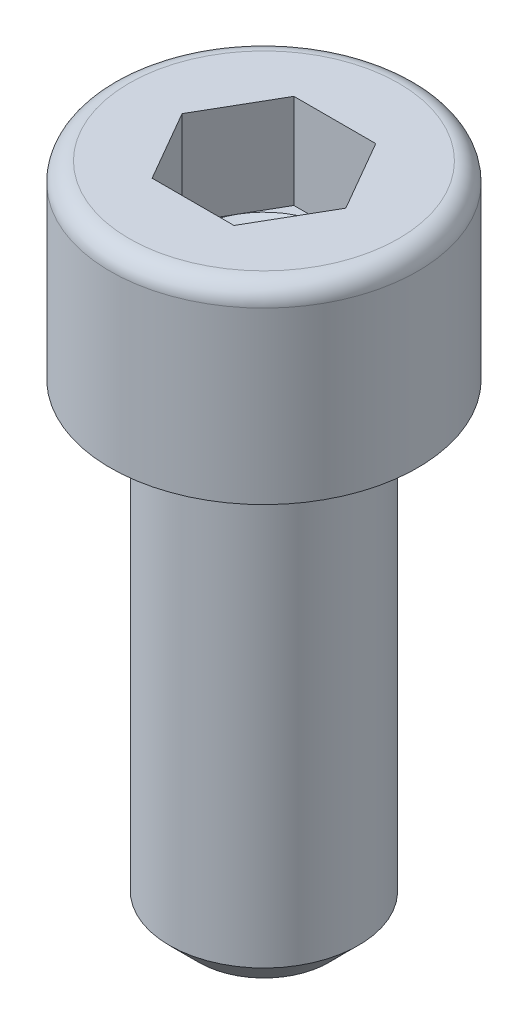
ISO-10303-21;
HEADER;
FILE_DESCRIPTION(('STEP AP214'),'2;1');
FILE_NAME('part.step','',(''),(''),'','','');
FILE_SCHEMA(('AUTOMOTIVE_DESIGN { 1 0 10303 214 1 1 1 1 }'));
ENDSEC;
DATA;
#1=APPLICATION_CONTEXT('core data for automotive mechanical design processes');
#2=APPLICATION_PROTOCOL_DEFINITION('international standard','automotive_design',2000,#1);
#3=PRODUCT_CONTEXT('',#1,'mechanical');
#4=PRODUCT('Part','Part','',(#3));
#5=PRODUCT_RELATED_PRODUCT_CATEGORY('part','',(#4));
#6=PRODUCT_DEFINITION_FORMATION('','',#4);
#7=PRODUCT_DEFINITION_CONTEXT('part definition',#1,'design');
#8=PRODUCT_DEFINITION('design','',#6,#7);
#9=PRODUCT_DEFINITION_SHAPE('','',#8);
#10=(LENGTH_UNIT() NAMED_UNIT(*) SI_UNIT(.MILLI.,.METRE.));
#11=(NAMED_UNIT(*) PLANE_ANGLE_UNIT() SI_UNIT($,.RADIAN.));
#12=(NAMED_UNIT(*) SI_UNIT($,.STERADIAN.) SOLID_ANGLE_UNIT());
#13=UNCERTAINTY_MEASURE_WITH_UNIT(LENGTH_MEASURE(1.E-05),#10,'distance_accuracy_value','');
#14=(GEOMETRIC_REPRESENTATION_CONTEXT(3) GLOBAL_UNCERTAINTY_ASSIGNED_CONTEXT((#13)) GLOBAL_UNIT_ASSIGNED_CONTEXT((#10,
#11,#12)) REPRESENTATION_CONTEXT('',''));
#15=CARTESIAN_POINT('',(0.,0.,0.));
#16=DIRECTION('',(0.,0.,1.));
#17=DIRECTION('',(1.,0.,0.));
#18=AXIS2_PLACEMENT_3D('',#15,#16,#17);
#19=CARTESIAN_POINT('',(2.99999999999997,8.00000000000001,0.));
#20=DIRECTION('',(0.,-1.,0.));
#21=DIRECTION('',(1.,0.,0.));
#22=AXIS2_PLACEMENT_3D('',#19,#20,#21);
#23=PLANE('',#22);
#24=CARTESIAN_POINT('',(0.,8.00000000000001,0.));
#25=DIRECTION('',(0.,1.,0.));
#26=DIRECTION('',(-1.,0.,0.));
#27=AXIS2_PLACEMENT_3D('',#24,#25,#26);
#28=CIRCLE('',#27,5.7);
#29=CARTESIAN_POINT('',(-5.70000000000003,8.00000000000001,0.));
#30=VERTEX_POINT('',#29);
#31=EDGE_CURVE('E173',#30,#30,#28,.T.);
#32=ORIENTED_EDGE('',*,*,#31,.T.);
#33=EDGE_LOOP('',(#32));
#34=FACE_BOUND('',#33,.T.);
#35=DIRECTION('',(0.5,0.,0.866025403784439));
#36=VECTOR('',#35,1.);
#37=CARTESIAN_POINT('',(1.73205080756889,8.00000000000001,-3.00000000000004));
#38=LINE('',#37,#36);
#39=CARTESIAN_POINT('',(1.73205080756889,8.00000000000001,-3.00000000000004));
#40=VERTEX_POINT('',#39);
#41=CARTESIAN_POINT('',(3.46410161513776,8.00000000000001,0.));
#42=VERTEX_POINT('',#41);
#43=EDGE_CURVE('E114',#40,#42,#38,.T.);
#44=ORIENTED_EDGE('',*,*,#43,.T.);
#45=DIRECTION('',(-0.499999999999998,0.,0.866025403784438));
#46=VECTOR('',#45,1.);
#47=CARTESIAN_POINT('',(1.7320508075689,8.00000000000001,2.99999999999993));
#48=LINE('',#47,#46);
#49=CARTESIAN_POINT('',(1.7320508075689,8.00000000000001,2.99999999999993));
#50=VERTEX_POINT('',#49);
#51=EDGE_CURVE('E132',#42,#50,#48,.T.);
#52=ORIENTED_EDGE('',*,*,#51,.T.);
#53=DIRECTION('',(-1.,0.,0.));
#54=VECTOR('',#53,1.);
#55=CARTESIAN_POINT('',(1.7320508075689,8.00000000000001,2.99999999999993));
#56=LINE('',#55,#54);
#57=CARTESIAN_POINT('',(-1.73205080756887,8.00000000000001,2.99999999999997));
#58=VERTEX_POINT('',#57);
#59=EDGE_CURVE('E135',#50,#58,#56,.T.);
#60=ORIENTED_EDGE('',*,*,#59,.T.);
#61=DIRECTION('',(-0.499999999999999,0.,-0.866025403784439));
#62=VECTOR('',#61,1.);
#63=CARTESIAN_POINT('',(-1.73205080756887,8.00000000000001,2.99999999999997));
#64=LINE('',#63,#62);
#65=CARTESIAN_POINT('',(-3.46410161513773,8.00000000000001,0.));
#66=VERTEX_POINT('',#65);
#67=EDGE_CURVE('E128',#58,#66,#64,.T.);
#68=ORIENTED_EDGE('',*,*,#67,.T.);
#69=DIRECTION('',(0.499999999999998,0.,-0.866025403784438));
#70=VECTOR('',#69,1.);
#71=CARTESIAN_POINT('',(-1.73205080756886,8.00000000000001,-3.00000000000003));
#72=LINE('',#71,#70);
#73=CARTESIAN_POINT('',(-1.73205080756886,8.00000000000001,-3.00000000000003));
#74=VERTEX_POINT('',#73);
#75=EDGE_CURVE('E115',#66,#74,#72,.T.);
#76=ORIENTED_EDGE('',*,*,#75,.T.);
#77=DIRECTION('',(1.,0.,0.));
#78=VECTOR('',#77,1.);
#79=CARTESIAN_POINT('',(1.73205080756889,8.00000000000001,-3.00000000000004));
#80=LINE('',#79,#78);
#81=EDGE_CURVE('E105',#74,#40,#80,.T.);
#82=ORIENTED_EDGE('',*,*,#81,.T.);
#83=EDGE_LOOP('',(#44,#52,#60,#68,#76,#82));
#84=FACE_BOUND('',#83,.T.);
#85=ADVANCED_FACE('F34',(#34,#84),#23,.F.);
#86=CARTESIAN_POINT('',(0.,-20.,0.));
#87=DIRECTION('',(0.,1.,0.));
#88=DIRECTION('',(0.,0.,0.999999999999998));
#89=AXIS2_PLACEMENT_3D('',#86,#87,#88);
#90=CYLINDRICAL_SURFACE('',#89,4.);
#91=CARTESIAN_POINT('',(0.,-18.75,0.));
#92=DIRECTION('',(0.,1.,0.));
#93=DIRECTION('',(0.,0.,0.999999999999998));
#94=AXIS2_PLACEMENT_3D('',#91,#92,#93);
#95=CIRCLE('',#94,4.);
#96=CARTESIAN_POINT('',(0.,-18.75,3.99999999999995));
#97=VERTEX_POINT('',#96);
#98=EDGE_CURVE('E42',#97,#97,#95,.T.);
#99=ORIENTED_EDGE('',*,*,#98,.T.);
#100=EDGE_LOOP('',(#99));
#101=FACE_BOUND('',#100,.T.);
#102=CARTESIAN_POINT('',(0.,0.,0.));
#103=DIRECTION('',(0.,1.,0.));
#104=DIRECTION('',(0.,0.,0.999999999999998));
#105=AXIS2_PLACEMENT_3D('',#102,#103,#104);
#106=CIRCLE('',#105,4.);
#107=CARTESIAN_POINT('',(0.,0.,3.99999999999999));
#108=VERTEX_POINT('',#107);
#109=EDGE_CURVE('E183',#108,#108,#106,.T.);
#110=ORIENTED_EDGE('',*,*,#109,.F.);
#111=EDGE_LOOP('',(#110));
#112=FACE_BOUND('',#111,.T.);
#113=ADVANCED_FACE('F36',(#101,#112),#90,.T.);
#114=CARTESIAN_POINT('',(0.,-20.,0.));
#115=DIRECTION('',(0.,1.,0.));
#116=DIRECTION('',(0.,0.,0.999999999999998));
#117=AXIS2_PLACEMENT_3D('',#114,#115,#116);
#118=PLANE('',#117);
#119=CARTESIAN_POINT('',(0.,-20.,0.));
#120=DIRECTION('',(0.,1.,0.));
#121=DIRECTION('',(0.,0.,0.999999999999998));
#122=AXIS2_PLACEMENT_3D('',#119,#120,#121);
#123=CIRCLE('',#122,2.75);
#124=CARTESIAN_POINT('',(0.,-20.,2.74999999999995));
#125=VERTEX_POINT('',#124);
#126=EDGE_CURVE('E11',#125,#125,#123,.F.);
#127=ORIENTED_EDGE('',*,*,#126,.T.);
#128=EDGE_LOOP('',(#127));
#129=FACE_BOUND('',#128,.T.);
#130=ADVANCED_FACE('F193',(#129),#118,.F.);
#131=CARTESIAN_POINT('',(0.,-18.75,0.));
#132=DIRECTION('',(0.,1.,0.));
#133=DIRECTION('',(0.,0.,0.999999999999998));
#134=AXIS2_PLACEMENT_3D('',#131,#132,#133);
#135=CONICAL_SURFACE('',#134,4.,0.785398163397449);
#136=ORIENTED_EDGE('',*,*,#126,.F.);
#137=EDGE_LOOP('',(#136));
#138=FACE_BOUND('',#137,.T.);
#139=ORIENTED_EDGE('',*,*,#98,.F.);
#140=EDGE_LOOP('',(#139));
#141=FACE_BOUND('',#140,.T.);
#142=ADVANCED_FACE('F190',(#138,#141),#135,.T.);
#143=CARTESIAN_POINT('',(0.,0.,0.));
#144=DIRECTION('',(0.,1.,0.));
#145=DIRECTION('',(-1.,0.,0.));
#146=AXIS2_PLACEMENT_3D('',#143,#144,#145);
#147=PLANE('',#146);
#148=ORIENTED_EDGE('',*,*,#109,.T.);
#149=EDGE_LOOP('',(#148));
#150=FACE_BOUND('',#149,.T.);
#151=CARTESIAN_POINT('',(0.,0.,0.));
#152=DIRECTION('',(0.,1.,0.));
#153=DIRECTION('',(-1.,0.,0.));
#154=AXIS2_PLACEMENT_3D('',#151,#152,#153);
#155=CIRCLE('',#154,6.5);
#156=CARTESIAN_POINT('',(-6.50000000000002,0.,0.));
#157=VERTEX_POINT('',#156);
#158=EDGE_CURVE('E180',#157,#157,#155,.T.);
#159=ORIENTED_EDGE('',*,*,#158,.F.);
#160=EDGE_LOOP('',(#159));
#161=FACE_BOUND('',#160,.T.);
#162=ADVANCED_FACE('F192',(#150,#161),#147,.F.);
#163=CARTESIAN_POINT('',(0.,8.00000000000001,0.));
#164=DIRECTION('',(0.,1.,0.));
#165=DIRECTION('',(-1.,0.,0.));
#166=AXIS2_PLACEMENT_3D('',#163,#164,#165);
#167=CYLINDRICAL_SURFACE('',#166,6.5);
#168=CARTESIAN_POINT('',(0.,7.19999999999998,0.));
#169=DIRECTION('',(0.,1.,0.));
#170=DIRECTION('',(-1.,0.,0.));
#171=AXIS2_PLACEMENT_3D('',#168,#169,#170);
#172=CIRCLE('',#171,6.5);
#173=CARTESIAN_POINT('',(-6.50000000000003,7.19999999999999,0.));
#174=VERTEX_POINT('',#173);
#175=EDGE_CURVE('E177',#174,#174,#172,.T.);
#176=ORIENTED_EDGE('',*,*,#175,.F.);
#177=EDGE_LOOP('',(#176));
#178=FACE_BOUND('',#177,.T.);
#179=ORIENTED_EDGE('',*,*,#158,.T.);
#180=EDGE_LOOP('',(#179));
#181=FACE_BOUND('',#180,.T.);
#182=ADVANCED_FACE('F200',(#178,#181),#167,.T.);
#183=CARTESIAN_POINT('',(0.,7.19999999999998,0.));
#184=DIRECTION('',(0.,1.,0.));
#185=DIRECTION('',(-1.,0.,0.));
#186=AXIS2_PLACEMENT_3D('',#183,#184,#185);
#187=TOROIDAL_SURFACE('',#186,5.7,0.8);
#188=ORIENTED_EDGE('',*,*,#31,.F.);
#189=EDGE_LOOP('',(#188));
#190=FACE_BOUND('',#189,.T.);
#191=ORIENTED_EDGE('',*,*,#175,.T.);
#192=EDGE_LOOP('',(#191));
#193=FACE_BOUND('',#192,.T.);
#194=ADVANCED_FACE('F215',(#190,#193),#187,.T.);
#195=CARTESIAN_POINT('',(-1.73205080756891,4.,-3.00000000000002));
#196=DIRECTION('',(0.866025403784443,0.,0.499999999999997));
#197=DIRECTION('',(0.499999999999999,0.,-0.866025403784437));
#198=AXIS2_PLACEMENT_3D('',#195,#196,#197);
#199=PLANE('',#198);
#200=ORIENTED_EDGE('',*,*,#75,.F.);
#201=DIRECTION('',(0.,1.,0.));
#202=VECTOR('',#201,1.);
#203=CARTESIAN_POINT('',(-3.4641016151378,4.,0.));
#204=LINE('',#203,#202);
#205=CARTESIAN_POINT('',(-3.4641016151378,4.,0.));
#206=VERTEX_POINT('',#205);
#207=EDGE_CURVE('E158',#206,#66,#204,.T.);
#208=ORIENTED_EDGE('',*,*,#207,.F.);
#209=DIRECTION('',(0.499999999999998,0.,-0.866025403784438));
#210=VECTOR('',#209,1.);
#211=CARTESIAN_POINT('',(-1.73205080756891,4.,-3.00000000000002));
#212=LINE('',#211,#210);
#213=CARTESIAN_POINT('',(-2.59807621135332,4.,-1.50000000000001));
#214=VERTEX_POINT('',#213);
#215=EDGE_CURVE('E138',#206,#214,#212,.T.);
#216=ORIENTED_EDGE('',*,*,#215,.T.);
#217=CARTESIAN_POINT('',(-1.73205080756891,4.,-3.00000000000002));
#218=VERTEX_POINT('',#217);
#219=EDGE_CURVE('E123',#214,#218,#212,.T.);
#220=ORIENTED_EDGE('',*,*,#219,.T.);
#221=DIRECTION('',(0.,1.,0.));
#222=VECTOR('',#221,1.);
#223=CARTESIAN_POINT('',(-1.73205080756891,4.,-3.00000000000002));
#224=LINE('',#223,#222);
#225=EDGE_CURVE('E108',#218,#74,#224,.T.);
#226=ORIENTED_EDGE('',*,*,#225,.T.);
#227=EDGE_LOOP('',(#200,#208,#216,#220,#226));
#228=FACE_BOUND('',#227,.T.);
#229=ADVANCED_FACE('F118',(#228),#199,.T.);
#230=CARTESIAN_POINT('',(1.73205080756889,4.,-3.));
#231=DIRECTION('',(0.,0.,0.999999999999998));
#232=DIRECTION('',(1.,0.,0.));
#233=AXIS2_PLACEMENT_3D('',#230,#231,#232);
#234=PLANE('',#233);
#235=ORIENTED_EDGE('',*,*,#81,.F.);
#236=ORIENTED_EDGE('',*,*,#225,.F.);
#237=DIRECTION('',(1.,0.,0.));
#238=VECTOR('',#237,1.);
#239=CARTESIAN_POINT('',(1.73205080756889,4.,-3.));
#240=LINE('',#239,#238);
#241=CARTESIAN_POINT('',(0.,4.,-3.));
#242=VERTEX_POINT('',#241);
#243=EDGE_CURVE('E49',#218,#242,#240,.T.);
#244=ORIENTED_EDGE('',*,*,#243,.T.);
#245=CARTESIAN_POINT('',(1.73205080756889,4.,-3.));
#246=VERTEX_POINT('',#245);
#247=EDGE_CURVE('E140',#242,#246,#240,.T.);
#248=ORIENTED_EDGE('',*,*,#247,.T.);
#249=DIRECTION('',(0.,1.,0.));
#250=VECTOR('',#249,1.);
#251=CARTESIAN_POINT('',(1.73205080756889,4.,-3.));
#252=LINE('',#251,#250);
#253=EDGE_CURVE('E110',#246,#40,#252,.T.);
#254=ORIENTED_EDGE('',*,*,#253,.T.);
#255=EDGE_LOOP('',(#235,#236,#244,#248,#254));
#256=FACE_BOUND('',#255,.T.);
#257=ADVANCED_FACE('F107',(#256),#234,.T.);
#258=CARTESIAN_POINT('',(1.73205080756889,4.,-3.));
#259=DIRECTION('',(-0.866025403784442,0.,0.499999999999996));
#260=DIRECTION('',(0.5,0.,0.866025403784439));
#261=AXIS2_PLACEMENT_3D('',#258,#259,#260);
#262=PLANE('',#261);
#263=ORIENTED_EDGE('',*,*,#43,.F.);
#264=ORIENTED_EDGE('',*,*,#253,.F.);
#265=DIRECTION('',(0.5,0.,0.866025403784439));
#266=VECTOR('',#265,1.);
#267=CARTESIAN_POINT('',(1.73205080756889,4.,-3.));
#268=LINE('',#267,#266);
#269=CARTESIAN_POINT('',(2.59807621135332,4.,-1.49999999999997));
#270=VERTEX_POINT('',#269);
#271=EDGE_CURVE('E143',#246,#270,#268,.T.);
#272=ORIENTED_EDGE('',*,*,#271,.T.);
#273=CARTESIAN_POINT('',(3.46410161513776,4.,0.));
#274=VERTEX_POINT('',#273);
#275=EDGE_CURVE('E142',#270,#274,#268,.T.);
#276=ORIENTED_EDGE('',*,*,#275,.T.);
#277=DIRECTION('',(0.,1.,0.));
#278=VECTOR('',#277,1.);
#279=CARTESIAN_POINT('',(3.46410161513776,4.,0.));
#280=LINE('',#279,#278);
#281=EDGE_CURVE('E166',#274,#42,#280,.T.);
#282=ORIENTED_EDGE('',*,*,#281,.T.);
#283=EDGE_LOOP('',(#263,#264,#272,#276,#282));
#284=FACE_BOUND('',#283,.T.);
#285=ADVANCED_FACE('F246',(#284),#262,.T.);
#286=CARTESIAN_POINT('',(1.73205080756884,4.,2.99999999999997));
#287=DIRECTION('',(-0.866025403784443,0.,-0.499999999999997));
#288=DIRECTION('',(-0.499999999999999,0.,0.866025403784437));
#289=AXIS2_PLACEMENT_3D('',#286,#287,#288);
#290=PLANE('',#289);
#291=ORIENTED_EDGE('',*,*,#51,.F.);
#292=ORIENTED_EDGE('',*,*,#281,.F.);
#293=DIRECTION('',(-0.499999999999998,0.,0.866025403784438));
#294=VECTOR('',#293,1.);
#295=CARTESIAN_POINT('',(1.73205080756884,4.,2.99999999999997));
#296=LINE('',#295,#294);
#297=CARTESIAN_POINT('',(2.59807621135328,4.,1.49999999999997));
#298=VERTEX_POINT('',#297);
#299=EDGE_CURVE('E147',#274,#298,#296,.T.);
#300=ORIENTED_EDGE('',*,*,#299,.T.);
#301=CARTESIAN_POINT('',(1.73205080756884,4.,2.99999999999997));
#302=VERTEX_POINT('',#301);
#303=EDGE_CURVE('E146',#298,#302,#296,.T.);
#304=ORIENTED_EDGE('',*,*,#303,.T.);
#305=DIRECTION('',(0.,1.,0.));
#306=VECTOR('',#305,1.);
#307=CARTESIAN_POINT('',(1.73205080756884,4.,2.99999999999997));
#308=LINE('',#307,#306);
#309=EDGE_CURVE('E163',#302,#50,#308,.T.);
#310=ORIENTED_EDGE('',*,*,#309,.T.);
#311=EDGE_LOOP('',(#291,#292,#300,#304,#310));
#312=FACE_BOUND('',#311,.T.);
#313=ADVANCED_FACE('F253',(#312),#290,.T.);
#314=CARTESIAN_POINT('',(1.73205080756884,4.,2.99999999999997));
#315=DIRECTION('',(0.,0.,-0.999999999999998));
#316=DIRECTION('',(-1.,0.,0.));
#317=AXIS2_PLACEMENT_3D('',#314,#315,#316);
#318=PLANE('',#317);
#319=ORIENTED_EDGE('',*,*,#59,.F.);
#320=ORIENTED_EDGE('',*,*,#309,.F.);
#321=DIRECTION('',(-1.,0.,0.));
#322=VECTOR('',#321,1.);
#323=CARTESIAN_POINT('',(1.73205080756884,4.,2.99999999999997));
#324=LINE('',#323,#322);
#325=CARTESIAN_POINT('',(0.,4.,2.99999999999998));
#326=VERTEX_POINT('',#325);
#327=EDGE_CURVE('E151',#302,#326,#324,.T.);
#328=ORIENTED_EDGE('',*,*,#327,.T.);
#329=CARTESIAN_POINT('',(-1.73205080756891,4.,2.99999999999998));
#330=VERTEX_POINT('',#329);
#331=EDGE_CURVE('E150',#326,#330,#324,.T.);
#332=ORIENTED_EDGE('',*,*,#331,.T.);
#333=DIRECTION('',(0.,1.,0.));
#334=VECTOR('',#333,1.);
#335=CARTESIAN_POINT('',(-1.73205080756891,4.,2.99999999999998));
#336=LINE('',#335,#334);
#337=EDGE_CURVE('E160',#330,#58,#336,.T.);
#338=ORIENTED_EDGE('',*,*,#337,.T.);
#339=EDGE_LOOP('',(#319,#320,#328,#332,#338));
#340=FACE_BOUND('',#339,.T.);
#341=ADVANCED_FACE('F261',(#340),#318,.T.);
#342=CARTESIAN_POINT('',(-1.73205080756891,4.,2.99999999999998));
#343=DIRECTION('',(0.866025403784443,0.,-0.499999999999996));
#344=DIRECTION('',(-0.499999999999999,0.,-0.866025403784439));
#345=AXIS2_PLACEMENT_3D('',#342,#343,#344);
#346=PLANE('',#345);
#347=ORIENTED_EDGE('',*,*,#67,.F.);
#348=ORIENTED_EDGE('',*,*,#337,.F.);
#349=DIRECTION('',(-0.499999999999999,0.,-0.866025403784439));
#350=VECTOR('',#349,1.);
#351=CARTESIAN_POINT('',(-1.73205080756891,4.,2.99999999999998));
#352=LINE('',#351,#350);
#353=CARTESIAN_POINT('',(-2.59807621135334,4.,1.49999999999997));
#354=VERTEX_POINT('',#353);
#355=EDGE_CURVE('E155',#330,#354,#352,.T.);
#356=ORIENTED_EDGE('',*,*,#355,.T.);
#357=EDGE_CURVE('E154',#354,#206,#352,.T.);
#358=ORIENTED_EDGE('',*,*,#357,.T.);
#359=ORIENTED_EDGE('',*,*,#207,.T.);
#360=EDGE_LOOP('',(#347,#348,#356,#358,#359));
#361=FACE_BOUND('',#360,.T.);
#362=ADVANCED_FACE('F269',(#361),#346,.T.);
#363=CARTESIAN_POINT('',(-5.19615242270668,4.,2.99999999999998));
#364=DIRECTION('',(0.,-1.,0.));
#365=DIRECTION('',(0.,0.,-0.999999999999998));
#366=AXIS2_PLACEMENT_3D('',#363,#364,#365);
#367=PLANE('',#366);
#368=ORIENTED_EDGE('',*,*,#243,.F.);
#369=ORIENTED_EDGE('',*,*,#219,.F.);
#370=CARTESIAN_POINT('',(0.,4.,0.));
#371=DIRECTION('',(0.,1.,0.));
#372=DIRECTION('',(-1.,0.,0.));
#373=AXIS2_PLACEMENT_3D('',#370,#371,#372);
#374=CIRCLE('',#373,3.);
#375=EDGE_CURVE('E349',#242,#214,#374,.T.);
#376=ORIENTED_EDGE('',*,*,#375,.F.);
#377=EDGE_LOOP('',(#368,#369,#376));
#378=FACE_BOUND('',#377,.T.);
#379=ADVANCED_FACE('F277',(#378),#367,.F.);
#380=ORIENTED_EDGE('',*,*,#215,.F.);
#381=ORIENTED_EDGE('',*,*,#357,.F.);
#382=EDGE_CURVE('E124',#214,#354,#374,.T.);
#383=ORIENTED_EDGE('',*,*,#382,.F.);
#384=EDGE_LOOP('',(#380,#381,#383));
#385=FACE_BOUND('',#384,.T.);
#386=ADVANCED_FACE('F285',(#385),#367,.F.);
#387=ORIENTED_EDGE('',*,*,#355,.F.);
#388=ORIENTED_EDGE('',*,*,#331,.F.);
#389=EDGE_CURVE('E170',#354,#326,#374,.T.);
#390=ORIENTED_EDGE('',*,*,#389,.F.);
#391=EDGE_LOOP('',(#387,#388,#390));
#392=FACE_BOUND('',#391,.T.);
#393=ADVANCED_FACE('F294',(#392),#367,.F.);
#394=ORIENTED_EDGE('',*,*,#327,.F.);
#395=ORIENTED_EDGE('',*,*,#303,.F.);
#396=EDGE_CURVE('E174',#326,#298,#374,.T.);
#397=ORIENTED_EDGE('',*,*,#396,.F.);
#398=EDGE_LOOP('',(#394,#395,#397));
#399=FACE_BOUND('',#398,.T.);
#400=ADVANCED_FACE('F301',(#399),#367,.F.);
#401=ORIENTED_EDGE('',*,*,#299,.F.);
#402=ORIENTED_EDGE('',*,*,#275,.F.);
#403=EDGE_CURVE('E344',#298,#270,#374,.T.);
#404=ORIENTED_EDGE('',*,*,#403,.F.);
#405=EDGE_LOOP('',(#401,#402,#404));
#406=FACE_BOUND('',#405,.T.);
#407=ADVANCED_FACE('F308',(#406),#367,.F.);
#408=ORIENTED_EDGE('',*,*,#271,.F.);
#409=ORIENTED_EDGE('',*,*,#247,.F.);
#410=EDGE_CURVE('E347',#270,#242,#374,.T.);
#411=ORIENTED_EDGE('',*,*,#410,.F.);
#412=EDGE_LOOP('',(#408,#409,#411));
#413=FACE_BOUND('',#412,.T.);
#414=ADVANCED_FACE('F288',(#413),#367,.F.);
#415=CARTESIAN_POINT('',(0.,4.,0.));
#416=DIRECTION('',(0.,1.,0.));
#417=DIRECTION('',(-1.,0.,0.));
#418=AXIS2_PLACEMENT_3D('',#415,#416,#417);
#419=CONICAL_SURFACE('',#418,3.,1.04719755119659);
#420=CARTESIAN_POINT('',(0.,2.26794919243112,0.));
#421=VERTEX_POINT('',#420);
#422=VERTEX_LOOP('',#421);
#423=FACE_BOUND('',#422,.T.);
#424=ORIENTED_EDGE('',*,*,#389,.T.);
#425=ORIENTED_EDGE('',*,*,#396,.T.);
#426=ORIENTED_EDGE('',*,*,#403,.T.);
#427=ORIENTED_EDGE('',*,*,#410,.T.);
#428=ORIENTED_EDGE('',*,*,#375,.T.);
#429=ORIENTED_EDGE('',*,*,#382,.T.);
#430=EDGE_LOOP('',(#424,#425,#426,#427,#428,#429));
#431=FACE_BOUND('',#430,.T.);
#432=ADVANCED_FACE('F213',(#423,#431),#419,.F.);
#433=CLOSED_SHELL('',(#85,#113,#130,#142,#162,#182,#194,#229,#257,#285,#313,#341,#362,#379,#386,
#393,#400,#407,#414,#432));
#434=MANIFOLD_SOLID_BREP('B2',#433);
#435=ADVANCED_BREP_SHAPE_REPRESENTATION('',(#18,#434),#14);
#436=SHAPE_DEFINITION_REPRESENTATION(#9,#435);
ENDSEC;
END-ISO-10303-21;
